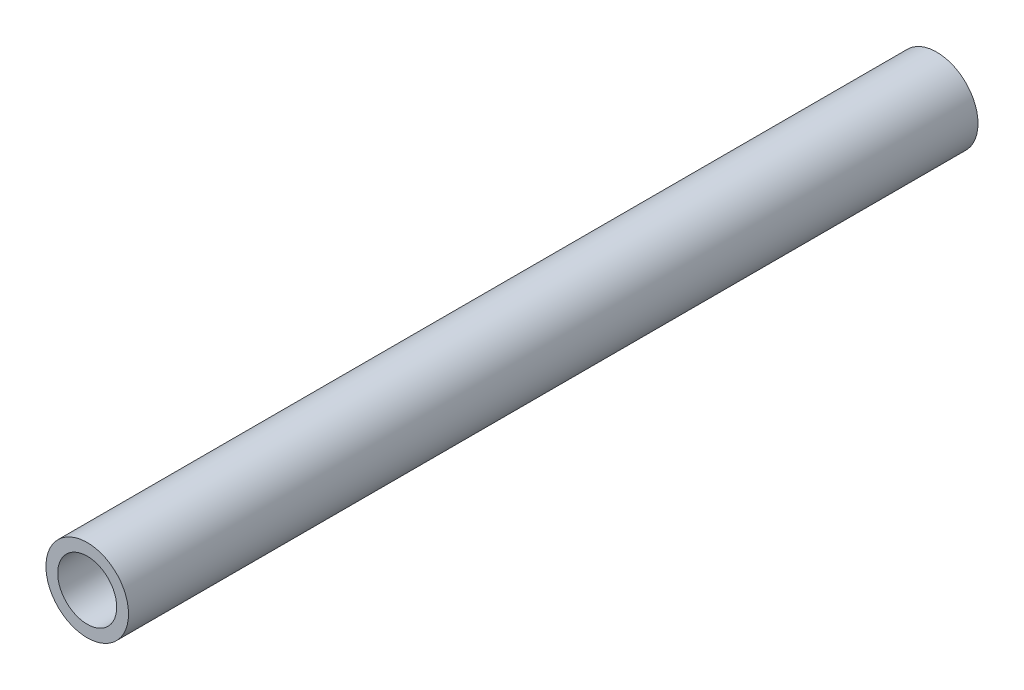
ISO-10303-21;
HEADER;
FILE_DESCRIPTION(('STEP AP214'),'2;1');
FILE_NAME('part.step','',(''),(''),'','','');
FILE_SCHEMA(('AUTOMOTIVE_DESIGN { 1 0 10303 214 1 1 1 1 }'));
ENDSEC;
DATA;
#1=APPLICATION_CONTEXT('core data for automotive mechanical design processes');
#2=APPLICATION_PROTOCOL_DEFINITION('international standard','automotive_design',2000,#1);
#3=PRODUCT_CONTEXT('',#1,'mechanical');
#4=PRODUCT('Part','Part','',(#3));
#5=PRODUCT_RELATED_PRODUCT_CATEGORY('part','',(#4));
#6=PRODUCT_DEFINITION_FORMATION('','',#4);
#7=PRODUCT_DEFINITION_CONTEXT('part definition',#1,'design');
#8=PRODUCT_DEFINITION('design','',#6,#7);
#9=PRODUCT_DEFINITION_SHAPE('','',#8);
#10=(LENGTH_UNIT() NAMED_UNIT(*) SI_UNIT(.MILLI.,.METRE.));
#11=(NAMED_UNIT(*) PLANE_ANGLE_UNIT() SI_UNIT($,.RADIAN.));
#12=(NAMED_UNIT(*) SI_UNIT($,.STERADIAN.) SOLID_ANGLE_UNIT());
#13=UNCERTAINTY_MEASURE_WITH_UNIT(LENGTH_MEASURE(1.E-05),#10,'distance_accuracy_value','');
#14=(GEOMETRIC_REPRESENTATION_CONTEXT(3) GLOBAL_UNCERTAINTY_ASSIGNED_CONTEXT((#13)) GLOBAL_UNIT_ASSIGNED_CONTEXT((#10,
#11,#12)) REPRESENTATION_CONTEXT('',''));
#15=CARTESIAN_POINT('',(0.,0.,0.));
#16=DIRECTION('',(0.,0.,1.));
#17=DIRECTION('',(1.,0.,0.));
#18=AXIS2_PLACEMENT_3D('',#15,#16,#17);
#19=CARTESIAN_POINT('',(0.,0.,228.6));
#20=DIRECTION('',(0.,0.,-1.));
#21=DIRECTION('',(-1.,0.,0.));
#22=AXIS2_PLACEMENT_3D('',#19,#20,#21);
#23=CYLINDRICAL_SURFACE('',#22,11.1125);
#24=CARTESIAN_POINT('',(0.,0.,228.6));
#25=DIRECTION('',(0.,0.,1.));
#26=DIRECTION('',(1.,0.,0.));
#27=AXIS2_PLACEMENT_3D('',#24,#25,#26);
#28=CIRCLE('',#27,11.1125);
#29=CARTESIAN_POINT('',(11.1125,0.,228.6));
#30=VERTEX_POINT('',#29);
#31=EDGE_CURVE('E10',#30,#30,#28,.T.);
#32=ORIENTED_EDGE('',*,*,#31,.F.);
#33=EDGE_LOOP('',(#32));
#34=FACE_BOUND('',#33,.T.);
#35=CARTESIAN_POINT('',(0.,0.,0.));
#36=DIRECTION('',(0.,0.,1.));
#37=DIRECTION('',(1.,0.,0.));
#38=AXIS2_PLACEMENT_3D('',#35,#36,#37);
#39=CIRCLE('',#38,11.1125);
#40=CARTESIAN_POINT('',(11.1125,0.,0.));
#41=VERTEX_POINT('',#40);
#42=EDGE_CURVE('E32',#41,#41,#39,.T.);
#43=ORIENTED_EDGE('',*,*,#42,.T.);
#44=EDGE_LOOP('',(#43));
#45=FACE_BOUND('',#44,.T.);
#46=ADVANCED_FACE('F29',(#34,#45),#23,.T.);
#47=CARTESIAN_POINT('',(0.,0.,228.6));
#48=DIRECTION('',(0.,0.,1.));
#49=DIRECTION('',(1.,0.,0.));
#50=AXIS2_PLACEMENT_3D('',#47,#48,#49);
#51=PLANE('',#50);
#52=CARTESIAN_POINT('',(0.,0.,228.6));
#53=DIRECTION('',(0.,0.,1.));
#54=DIRECTION('',(1.,0.,0.));
#55=AXIS2_PLACEMENT_3D('',#52,#53,#54);
#56=CIRCLE('',#55,7.9375);
#57=CARTESIAN_POINT('',(7.9375,0.,228.6));
#58=VERTEX_POINT('',#57);
#59=EDGE_CURVE('E41',#58,#58,#56,.T.);
#60=ORIENTED_EDGE('',*,*,#59,.F.);
#61=EDGE_LOOP('',(#60));
#62=FACE_BOUND('',#61,.T.);
#63=ORIENTED_EDGE('',*,*,#31,.T.);
#64=EDGE_LOOP('',(#63));
#65=FACE_BOUND('',#64,.T.);
#66=ADVANCED_FACE('F56',(#62,#65),#51,.T.);
#67=CARTESIAN_POINT('',(0.,0.,0.));
#68=DIRECTION('',(0.,0.,1.));
#69=DIRECTION('',(1.,0.,0.));
#70=AXIS2_PLACEMENT_3D('',#67,#68,#69);
#71=PLANE('',#70);
#72=CARTESIAN_POINT('',(0.,0.,0.));
#73=DIRECTION('',(0.,0.,1.));
#74=DIRECTION('',(1.,0.,0.));
#75=AXIS2_PLACEMENT_3D('',#72,#73,#74);
#76=CIRCLE('',#75,7.9375);
#77=CARTESIAN_POINT('',(7.9375,0.,0.));
#78=VERTEX_POINT('',#77);
#79=EDGE_CURVE('E39',#78,#78,#76,.T.);
#80=ORIENTED_EDGE('',*,*,#79,.T.);
#81=EDGE_LOOP('',(#80));
#82=FACE_BOUND('',#81,.T.);
#83=ORIENTED_EDGE('',*,*,#42,.F.);
#84=EDGE_LOOP('',(#83));
#85=FACE_BOUND('',#84,.T.);
#86=ADVANCED_FACE('F47',(#82,#85),#71,.F.);
#87=CARTESIAN_POINT('',(0.,0.,0.));
#88=DIRECTION('',(0.,0.,1.));
#89=DIRECTION('',(1.,0.,0.));
#90=AXIS2_PLACEMENT_3D('',#87,#88,#89);
#91=CYLINDRICAL_SURFACE('',#90,7.9375);
#92=ORIENTED_EDGE('',*,*,#79,.F.);
#93=EDGE_LOOP('',(#92));
#94=FACE_BOUND('',#93,.T.);
#95=ORIENTED_EDGE('',*,*,#59,.T.);
#96=EDGE_LOOP('',(#95));
#97=FACE_BOUND('',#96,.T.);
#98=ADVANCED_FACE('F50',(#94,#97),#91,.F.);
#99=CLOSED_SHELL('',(#46,#66,#86,#98));
#100=MANIFOLD_SOLID_BREP('B2',#99);
#101=ADVANCED_BREP_SHAPE_REPRESENTATION('',(#18,#100),#14);
#102=SHAPE_DEFINITION_REPRESENTATION(#9,#101);
ENDSEC;
END-ISO-10303-21;
